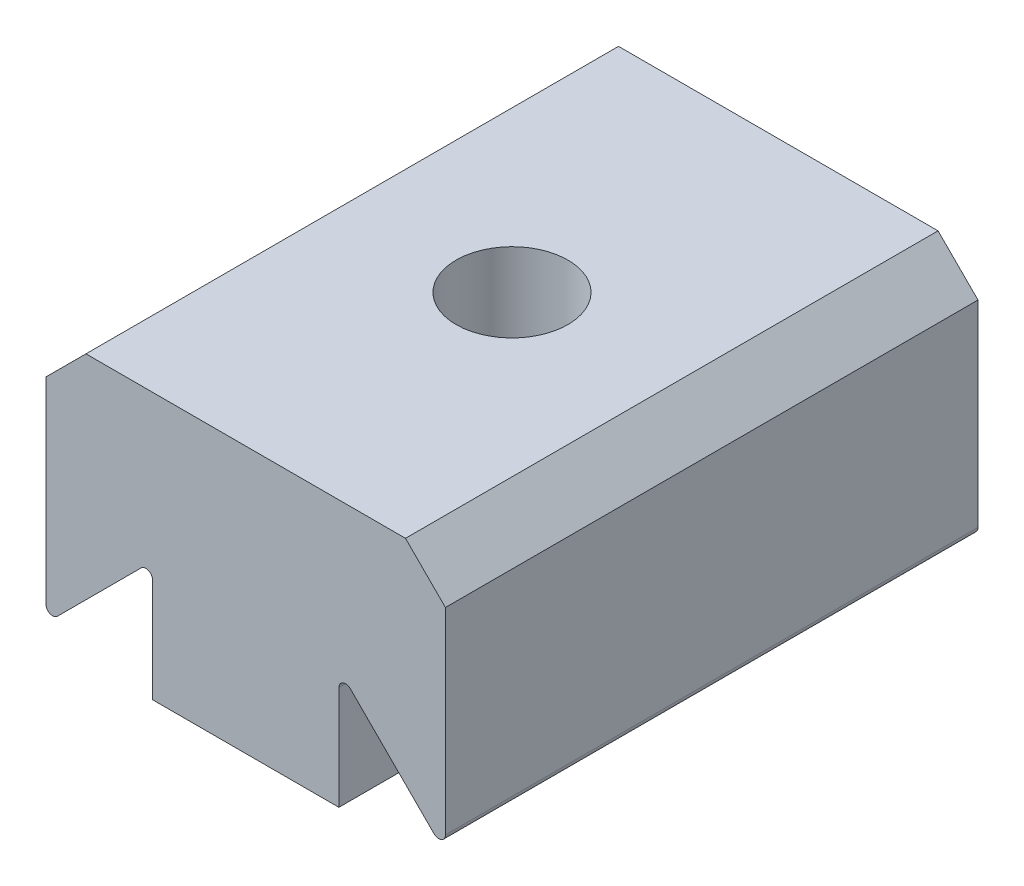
ISO-10303-21;
HEADER;
FILE_DESCRIPTION(('STEP AP214'),'2;1');
FILE_NAME('part.step','',(''),(''),'','','');
FILE_SCHEMA(('AUTOMOTIVE_DESIGN { 1 0 10303 214 1 1 1 1 }'));
ENDSEC;
DATA;
#1=APPLICATION_CONTEXT('core data for automotive mechanical design processes');
#2=APPLICATION_PROTOCOL_DEFINITION('international standard','automotive_design',2000,#1);
#3=PRODUCT_CONTEXT('',#1,'mechanical');
#4=PRODUCT('Part','Part','',(#3));
#5=PRODUCT_RELATED_PRODUCT_CATEGORY('part','',(#4));
#6=PRODUCT_DEFINITION_FORMATION('','',#4);
#7=PRODUCT_DEFINITION_CONTEXT('part definition',#1,'design');
#8=PRODUCT_DEFINITION('design','',#6,#7);
#9=PRODUCT_DEFINITION_SHAPE('','',#8);
#10=(LENGTH_UNIT() NAMED_UNIT(*) SI_UNIT(.MILLI.,.METRE.));
#11=(NAMED_UNIT(*) PLANE_ANGLE_UNIT() SI_UNIT($,.RADIAN.));
#12=(NAMED_UNIT(*) SI_UNIT($,.STERADIAN.) SOLID_ANGLE_UNIT());
#13=UNCERTAINTY_MEASURE_WITH_UNIT(LENGTH_MEASURE(1.E-05),#10,'distance_accuracy_value','');
#14=(GEOMETRIC_REPRESENTATION_CONTEXT(3) GLOBAL_UNCERTAINTY_ASSIGNED_CONTEXT((#13)) GLOBAL_UNIT_ASSIGNED_CONTEXT((#10,
#11,#12)) REPRESENTATION_CONTEXT('',''));
#15=CARTESIAN_POINT('',(0.,0.,0.));
#16=DIRECTION('',(0.,0.,1.));
#17=DIRECTION('',(1.,0.,0.));
#18=AXIS2_PLACEMENT_3D('',#15,#16,#17);
#19=CARTESIAN_POINT('',(-11.,16.5,10.));
#20=DIRECTION('',(0.,1.,0.));
#21=DIRECTION('',(0.,0.,1.));
#22=AXIS2_PLACEMENT_3D('',#19,#20,#21);
#23=PLANE('',#22);
#24=CARTESIAN_POINT('',(-3.5,16.5,0.));
#25=DIRECTION('',(0.,1.,0.));
#26=DIRECTION('',(0.,0.,1.));
#27=AXIS2_PLACEMENT_3D('',#24,#25,#26);
#28=CIRCLE('',#27,2.1);
#29=CARTESIAN_POINT('',(-3.5,16.5,2.09999999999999));
#30=VERTEX_POINT('',#29);
#31=EDGE_CURVE('E307',#30,#30,#28,.T.);
#32=ORIENTED_EDGE('',*,*,#31,.T.);
#33=EDGE_LOOP('',(#32));
#34=FACE_BOUND('',#33,.T.);
#35=DIRECTION('',(0.,0.,1.));
#36=VECTOR('',#35,1.);
#37=CARTESIAN_POINT('',(-7.00000000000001,16.5,10.));
#38=LINE('',#37,#36);
#39=CARTESIAN_POINT('',(-7.00000000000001,16.5,-10.));
#40=VERTEX_POINT('',#39);
#41=CARTESIAN_POINT('',(-7.00000000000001,16.5,10.));
#42=VERTEX_POINT('',#41);
#43=EDGE_CURVE('E171',#40,#42,#38,.T.);
#44=ORIENTED_EDGE('',*,*,#43,.F.);
#45=DIRECTION('',(1.,0.,0.));
#46=VECTOR('',#45,1.);
#47=CARTESIAN_POINT('',(-11.,16.5,-10.));
#48=LINE('',#47,#46);
#49=CARTESIAN_POINT('',(0.,16.5,-10.));
#50=VERTEX_POINT('',#49);
#51=EDGE_CURVE('E219',#40,#50,#48,.T.);
#52=ORIENTED_EDGE('',*,*,#51,.T.);
#53=DIRECTION('',(0.,0.,1.));
#54=VECTOR('',#53,1.);
#55=CARTESIAN_POINT('',(0.,16.5,10.));
#56=LINE('',#55,#54);
#57=CARTESIAN_POINT('',(0.,16.5,10.));
#58=VERTEX_POINT('',#57);
#59=EDGE_CURVE('E204',#50,#58,#56,.T.);
#60=ORIENTED_EDGE('',*,*,#59,.T.);
#61=DIRECTION('',(1.,0.,0.));
#62=VECTOR('',#61,1.);
#63=CARTESIAN_POINT('',(-11.,16.5,10.));
#64=LINE('',#63,#62);
#65=EDGE_CURVE('E227',#42,#58,#64,.T.);
#66=ORIENTED_EDGE('',*,*,#65,.F.);
#67=EDGE_LOOP('',(#44,#52,#60,#66));
#68=FACE_BOUND('',#67,.T.);
#69=ADVANCED_FACE('F28',(#34,#68),#23,.F.);
#70=CARTESIAN_POINT('',(4.,16.5,10.));
#71=DIRECTION('',(0.,0.,1.));
#72=DIRECTION('',(1.,0.,0.));
#73=AXIS2_PLACEMENT_3D('',#70,#71,#72);
#74=PLANE('',#73);
#75=DIRECTION('',(0.,1.,0.));
#76=VECTOR('',#75,1.);
#77=CARTESIAN_POINT('',(4.,26.5,10.));
#78=LINE('',#77,#76);
#79=CARTESIAN_POINT('',(4.,17.6035533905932,10.));
#80=VERTEX_POINT('',#79);
#81=CARTESIAN_POINT('',(4.,25.,10.));
#82=VERTEX_POINT('',#81);
#83=EDGE_CURVE('E221',#80,#82,#78,.T.);
#84=ORIENTED_EDGE('',*,*,#83,.T.);
#85=DIRECTION('',(0.707106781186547,-0.707106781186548,0.));
#86=VECTOR('',#85,1.);
#87=CARTESIAN_POINT('',(8.25000000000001,20.75,10.));
#88=LINE('',#87,#86);
#89=CARTESIAN_POINT('',(2.5,26.5,10.));
#90=VERTEX_POINT('',#89);
#91=EDGE_CURVE('E36',#82,#90,#88,.F.);
#92=ORIENTED_EDGE('',*,*,#91,.T.);
#93=DIRECTION('',(-1.,0.,0.));
#94=VECTOR('',#93,1.);
#95=CARTESIAN_POINT('',(-11.,26.5,9.99999999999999));
#96=LINE('',#95,#94);
#97=CARTESIAN_POINT('',(-9.50000000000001,26.5,9.99999999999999));
#98=VERTEX_POINT('',#97);
#99=EDGE_CURVE('E223',#90,#98,#96,.T.);
#100=ORIENTED_EDGE('',*,*,#99,.T.);
#101=DIRECTION('',(0.70710678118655,0.707106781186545,0.));
#102=VECTOR('',#101,1.);
#103=CARTESIAN_POINT('',(-7.74999999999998,28.25,9.99999999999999));
#104=LINE('',#103,#102);
#105=CARTESIAN_POINT('',(-11.,25.,9.99999999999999));
#106=VERTEX_POINT('',#105);
#107=EDGE_CURVE('E43',#98,#106,#104,.F.);
#108=ORIENTED_EDGE('',*,*,#107,.T.);
#109=DIRECTION('',(0.,-1.,0.));
#110=VECTOR('',#109,1.);
#111=CARTESIAN_POINT('',(-11.,26.5,9.99999999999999));
#112=LINE('',#111,#110);
#113=CARTESIAN_POINT('',(-11.,17.6035533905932,10.));
#114=VERTEX_POINT('',#113);
#115=EDGE_CURVE('E225',#106,#114,#112,.T.);
#116=ORIENTED_EDGE('',*,*,#115,.T.);
#117=CARTESIAN_POINT('',(-10.75,17.6035533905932,10.));
#118=DIRECTION('',(0.,0.,1.));
#119=DIRECTION('',(1.,0.,0.));
#120=AXIS2_PLACEMENT_3D('',#117,#118,#119);
#121=CIRCLE('',#120,0.250000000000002);
#122=CARTESIAN_POINT('',(-10.5732233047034,17.4267766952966,10.));
#123=VERTEX_POINT('',#122);
#124=EDGE_CURVE('E156',#114,#123,#121,.T.);
#125=ORIENTED_EDGE('',*,*,#124,.T.);
#126=DIRECTION('',(0.707106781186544,0.707106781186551,0.));
#127=VECTOR('',#126,1.);
#128=CARTESIAN_POINT('',(-10.5732233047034,17.4267766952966,10.));
#129=LINE('',#128,#127);
#130=CARTESIAN_POINT('',(-7.42677669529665,20.5732233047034,10.));
#131=VERTEX_POINT('',#130);
#132=EDGE_CURVE('E136',#123,#131,#129,.T.);
#133=ORIENTED_EDGE('',*,*,#132,.T.);
#134=CARTESIAN_POINT('',(-7.25000000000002,20.3964466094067,10.));
#135=DIRECTION('',(0.,0.,-1.));
#136=DIRECTION('',(-1.,0.,0.));
#137=AXIS2_PLACEMENT_3D('',#134,#135,#136);
#138=CIRCLE('',#137,0.249999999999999);
#139=CARTESIAN_POINT('',(-7.00000000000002,20.3964466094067,10.));
#140=VERTEX_POINT('',#139);
#141=EDGE_CURVE('E147',#131,#140,#138,.T.);
#142=ORIENTED_EDGE('',*,*,#141,.T.);
#143=DIRECTION('',(0.,-1.,0.));
#144=VECTOR('',#143,1.);
#145=CARTESIAN_POINT('',(-7.00000000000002,20.3964466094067,10.));
#146=LINE('',#145,#144);
#147=EDGE_CURVE('E158',#140,#42,#146,.T.);
#148=ORIENTED_EDGE('',*,*,#147,.T.);
#149=ORIENTED_EDGE('',*,*,#65,.T.);
#150=DIRECTION('',(0.,-1.,0.));
#151=VECTOR('',#150,1.);
#152=CARTESIAN_POINT('',(0.,20.3964466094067,10.));
#153=LINE('',#152,#151);
#154=CARTESIAN_POINT('',(0.,20.3964466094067,10.));
#155=VERTEX_POINT('',#154);
#156=EDGE_CURVE('E180',#155,#58,#153,.T.);
#157=ORIENTED_EDGE('',*,*,#156,.F.);
#158=CARTESIAN_POINT('',(0.25,20.3964466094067,10.));
#159=DIRECTION('',(0.,0.,1.));
#160=DIRECTION('',(1.,0.,0.));
#161=AXIS2_PLACEMENT_3D('',#158,#159,#160);
#162=CIRCLE('',#161,0.249999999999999);
#163=CARTESIAN_POINT('',(0.426776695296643,20.5732233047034,10.));
#164=VERTEX_POINT('',#163);
#165=EDGE_CURVE('E177',#164,#155,#162,.T.);
#166=ORIENTED_EDGE('',*,*,#165,.F.);
#167=DIRECTION('',(-0.707106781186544,0.707106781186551,0.));
#168=VECTOR('',#167,1.);
#169=CARTESIAN_POINT('',(3.57322330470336,17.4267766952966,10.));
#170=LINE('',#169,#168);
#171=CARTESIAN_POINT('',(3.57322330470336,17.4267766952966,10.));
#172=VERTEX_POINT('',#171);
#173=EDGE_CURVE('E186',#172,#164,#170,.T.);
#174=ORIENTED_EDGE('',*,*,#173,.F.);
#175=CARTESIAN_POINT('',(3.75,17.6035533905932,10.));
#176=DIRECTION('',(0.,0.,-1.));
#177=DIRECTION('',(-1.,0.,0.));
#178=AXIS2_PLACEMENT_3D('',#175,#176,#177);
#179=CIRCLE('',#178,0.250000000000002);
#180=EDGE_CURVE('E183',#80,#172,#179,.T.);
#181=ORIENTED_EDGE('',*,*,#180,.F.);
#182=EDGE_LOOP('',(#84,#92,#100,#108,#116,#125,#133,#142,#148,#149,#157,#166,#174,#181));
#183=FACE_BOUND('',#182,.T.);
#184=ADVANCED_FACE('F154',(#183),#74,.T.);
#185=CARTESIAN_POINT('',(4.,16.5,-10.));
#186=DIRECTION('',(0.,0.,1.));
#187=DIRECTION('',(1.,0.,0.));
#188=AXIS2_PLACEMENT_3D('',#185,#186,#187);
#189=PLANE('',#188);
#190=DIRECTION('',(-1.,0.,0.));
#191=VECTOR('',#190,1.);
#192=CARTESIAN_POINT('',(-11.,26.5,-10.));
#193=LINE('',#192,#191);
#194=CARTESIAN_POINT('',(2.5,26.5,-10.));
#195=VERTEX_POINT('',#194);
#196=CARTESIAN_POINT('',(-9.50000000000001,26.5,-10.));
#197=VERTEX_POINT('',#196);
#198=EDGE_CURVE('E214',#195,#197,#193,.T.);
#199=ORIENTED_EDGE('',*,*,#198,.F.);
#200=DIRECTION('',(-0.707106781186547,0.707106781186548,0.));
#201=VECTOR('',#200,1.);
#202=CARTESIAN_POINT('',(2.5,26.5,-10.));
#203=LINE('',#202,#201);
#204=CARTESIAN_POINT('',(4.,25.,-10.));
#205=VERTEX_POINT('',#204);
#206=EDGE_CURVE('E236',#195,#205,#203,.F.);
#207=ORIENTED_EDGE('',*,*,#206,.T.);
#208=DIRECTION('',(0.,1.,0.));
#209=VECTOR('',#208,1.);
#210=CARTESIAN_POINT('',(4.,26.5,-10.));
#211=LINE('',#210,#209);
#212=CARTESIAN_POINT('',(4.,17.6035533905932,-10.));
#213=VERTEX_POINT('',#212);
#214=EDGE_CURVE('E212',#213,#205,#211,.T.);
#215=ORIENTED_EDGE('',*,*,#214,.F.);
#216=CARTESIAN_POINT('',(3.75,17.6035533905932,-10.));
#217=DIRECTION('',(0.,0.,-1.));
#218=DIRECTION('',(-1.,0.,0.));
#219=AXIS2_PLACEMENT_3D('',#216,#217,#218);
#220=CIRCLE('',#219,0.250000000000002);
#221=CARTESIAN_POINT('',(3.57322330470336,17.4267766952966,-10.));
#222=VERTEX_POINT('',#221);
#223=EDGE_CURVE('E195',#213,#222,#220,.T.);
#224=ORIENTED_EDGE('',*,*,#223,.T.);
#225=DIRECTION('',(-0.707106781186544,0.707106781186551,0.));
#226=VECTOR('',#225,1.);
#227=CARTESIAN_POINT('',(3.57322330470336,17.4267766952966,-10.));
#228=LINE('',#227,#226);
#229=CARTESIAN_POINT('',(0.426776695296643,20.5732233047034,-10.));
#230=VERTEX_POINT('',#229);
#231=EDGE_CURVE('E198',#222,#230,#228,.T.);
#232=ORIENTED_EDGE('',*,*,#231,.T.);
#233=CARTESIAN_POINT('',(0.25,20.3964466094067,-10.));
#234=DIRECTION('',(0.,0.,1.));
#235=DIRECTION('',(1.,0.,0.));
#236=AXIS2_PLACEMENT_3D('',#233,#234,#235);
#237=CIRCLE('',#236,0.249999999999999);
#238=CARTESIAN_POINT('',(0.,20.3964466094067,-10.));
#239=VERTEX_POINT('',#238);
#240=EDGE_CURVE('E189',#230,#239,#237,.T.);
#241=ORIENTED_EDGE('',*,*,#240,.T.);
#242=DIRECTION('',(0.,-1.,0.));
#243=VECTOR('',#242,1.);
#244=CARTESIAN_POINT('',(0.,20.3964466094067,-10.));
#245=LINE('',#244,#243);
#246=EDGE_CURVE('E192',#239,#50,#245,.T.);
#247=ORIENTED_EDGE('',*,*,#246,.T.);
#248=ORIENTED_EDGE('',*,*,#51,.F.);
#249=DIRECTION('',(0.,-1.,0.));
#250=VECTOR('',#249,1.);
#251=CARTESIAN_POINT('',(-7.00000000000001,20.3964466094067,-10.));
#252=LINE('',#251,#250);
#253=CARTESIAN_POINT('',(-7.00000000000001,20.3964466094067,-10.));
#254=VERTEX_POINT('',#253);
#255=EDGE_CURVE('E143',#254,#40,#252,.T.);
#256=ORIENTED_EDGE('',*,*,#255,.F.);
#257=CARTESIAN_POINT('',(-7.25000000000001,20.3964466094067,-10.));
#258=DIRECTION('',(0.,0.,-1.));
#259=DIRECTION('',(-1.,0.,0.));
#260=AXIS2_PLACEMENT_3D('',#257,#258,#259);
#261=CIRCLE('',#260,0.249999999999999);
#262=CARTESIAN_POINT('',(-7.42677669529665,20.5732233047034,-10.));
#263=VERTEX_POINT('',#262);
#264=EDGE_CURVE('E163',#263,#254,#261,.T.);
#265=ORIENTED_EDGE('',*,*,#264,.F.);
#266=DIRECTION('',(0.707106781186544,0.707106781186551,0.));
#267=VECTOR('',#266,1.);
#268=CARTESIAN_POINT('',(-10.5732233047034,17.4267766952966,-10.));
#269=LINE('',#268,#267);
#270=CARTESIAN_POINT('',(-10.5732233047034,17.4267766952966,-10.));
#271=VERTEX_POINT('',#270);
#272=EDGE_CURVE('E139',#271,#263,#269,.T.);
#273=ORIENTED_EDGE('',*,*,#272,.F.);
#274=CARTESIAN_POINT('',(-10.75,17.6035533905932,-10.));
#275=DIRECTION('',(0.,0.,1.));
#276=DIRECTION('',(1.,0.,0.));
#277=AXIS2_PLACEMENT_3D('',#274,#275,#276);
#278=CIRCLE('',#277,0.250000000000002);
#279=CARTESIAN_POINT('',(-11.,17.6035533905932,-10.));
#280=VERTEX_POINT('',#279);
#281=EDGE_CURVE('E166',#280,#271,#278,.T.);
#282=ORIENTED_EDGE('',*,*,#281,.F.);
#283=DIRECTION('',(0.,-1.,0.));
#284=VECTOR('',#283,1.);
#285=CARTESIAN_POINT('',(-11.,26.5,-10.));
#286=LINE('',#285,#284);
#287=CARTESIAN_POINT('',(-11.,25.,-10.));
#288=VERTEX_POINT('',#287);
#289=EDGE_CURVE('E217',#288,#280,#286,.T.);
#290=ORIENTED_EDGE('',*,*,#289,.F.);
#291=DIRECTION('',(-0.70710678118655,-0.707106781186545,0.));
#292=VECTOR('',#291,1.);
#293=CARTESIAN_POINT('',(-11.,25.,-10.));
#294=LINE('',#293,#292);
#295=EDGE_CURVE('E234',#288,#197,#294,.F.);
#296=ORIENTED_EDGE('',*,*,#295,.T.);
#297=EDGE_LOOP('',(#199,#207,#215,#224,#232,#241,#247,#248,#256,#265,#273,#282,#290,#296));
#298=FACE_BOUND('',#297,.T.);
#299=ADVANCED_FACE('F251',(#298),#189,.F.);
#300=CARTESIAN_POINT('',(4.,26.5,10.));
#301=DIRECTION('',(-1.,0.,0.));
#302=DIRECTION('',(0.,0.,1.));
#303=AXIS2_PLACEMENT_3D('',#300,#301,#302);
#304=PLANE('',#303);
#305=ORIENTED_EDGE('',*,*,#214,.T.);
#306=DIRECTION('',(0.,0.,1.));
#307=VECTOR('',#306,1.);
#308=CARTESIAN_POINT('',(4.,25.,10.));
#309=LINE('',#308,#307);
#310=EDGE_CURVE('E51',#205,#82,#309,.T.);
#311=ORIENTED_EDGE('',*,*,#310,.T.);
#312=ORIENTED_EDGE('',*,*,#83,.F.);
#313=DIRECTION('',(0.,0.,1.));
#314=VECTOR('',#313,1.);
#315=CARTESIAN_POINT('',(4.,17.6035533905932,-10.));
#316=LINE('',#315,#314);
#317=EDGE_CURVE('E207',#213,#80,#316,.T.);
#318=ORIENTED_EDGE('',*,*,#317,.F.);
#319=EDGE_LOOP('',(#305,#311,#312,#318));
#320=FACE_BOUND('',#319,.T.);
#321=ADVANCED_FACE('F30',(#320),#304,.F.);
#322=CARTESIAN_POINT('',(-11.,26.5,9.99999999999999));
#323=DIRECTION('',(0.,-1.,0.));
#324=DIRECTION('',(0.,0.,-1.));
#325=AXIS2_PLACEMENT_3D('',#322,#323,#324);
#326=PLANE('',#325);
#327=CARTESIAN_POINT('',(-3.5,26.5,0.));
#328=DIRECTION('',(0.,1.,0.));
#329=DIRECTION('',(0.,0.,1.));
#330=AXIS2_PLACEMENT_3D('',#327,#328,#329);
#331=CIRCLE('',#330,2.09999999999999);
#332=CARTESIAN_POINT('',(-3.5,26.5,2.09999999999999));
#333=VERTEX_POINT('',#332);
#334=EDGE_CURVE('E152',#333,#333,#331,.T.);
#335=ORIENTED_EDGE('',*,*,#334,.F.);
#336=EDGE_LOOP('',(#335));
#337=FACE_BOUND('',#336,.T.);
#338=ORIENTED_EDGE('',*,*,#99,.F.);
#339=DIRECTION('',(0.,0.,-1.));
#340=VECTOR('',#339,1.);
#341=CARTESIAN_POINT('',(2.5,26.5,10.));
#342=LINE('',#341,#340);
#343=EDGE_CURVE('E231',#90,#195,#342,.T.);
#344=ORIENTED_EDGE('',*,*,#343,.T.);
#345=ORIENTED_EDGE('',*,*,#198,.T.);
#346=DIRECTION('',(0.,0.,1.));
#347=VECTOR('',#346,1.);
#348=CARTESIAN_POINT('',(-9.50000000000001,26.5,9.99999999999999));
#349=LINE('',#348,#347);
#350=EDGE_CURVE('E229',#197,#98,#349,.T.);
#351=ORIENTED_EDGE('',*,*,#350,.T.);
#352=EDGE_LOOP('',(#338,#344,#345,#351));
#353=FACE_BOUND('',#352,.T.);
#354=ADVANCED_FACE('F245',(#337,#353),#326,.F.);
#355=CARTESIAN_POINT('',(-11.,26.5,9.99999999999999));
#356=DIRECTION('',(1.,0.,0.));
#357=DIRECTION('',(0.,1.,0.));
#358=AXIS2_PLACEMENT_3D('',#355,#356,#357);
#359=PLANE('',#358);
#360=ORIENTED_EDGE('',*,*,#115,.F.);
#361=DIRECTION('',(0.,0.,-1.));
#362=VECTOR('',#361,1.);
#363=CARTESIAN_POINT('',(-11.,25.,9.99999999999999));
#364=LINE('',#363,#362);
#365=EDGE_CURVE('E11',#106,#288,#364,.T.);
#366=ORIENTED_EDGE('',*,*,#365,.T.);
#367=ORIENTED_EDGE('',*,*,#289,.T.);
#368=DIRECTION('',(0.,0.,1.));
#369=VECTOR('',#368,1.);
#370=CARTESIAN_POINT('',(-11.,17.6035533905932,-10.));
#371=LINE('',#370,#369);
#372=EDGE_CURVE('E172',#280,#114,#371,.T.);
#373=ORIENTED_EDGE('',*,*,#372,.T.);
#374=EDGE_LOOP('',(#360,#366,#367,#373));
#375=FACE_BOUND('',#374,.T.);
#376=ADVANCED_FACE('F296',(#375),#359,.F.);
#377=CARTESIAN_POINT('',(0.,20.3964466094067,-10.));
#378=DIRECTION('',(-1.,0.,0.));
#379=DIRECTION('',(0.,-1.,0.));
#380=AXIS2_PLACEMENT_3D('',#377,#378,#379);
#381=PLANE('',#380);
#382=ORIENTED_EDGE('',*,*,#246,.F.);
#383=DIRECTION('',(0.,0.,1.));
#384=VECTOR('',#383,1.);
#385=CARTESIAN_POINT('',(0.,20.3964466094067,-10.));
#386=LINE('',#385,#384);
#387=EDGE_CURVE('E201',#239,#155,#386,.T.);
#388=ORIENTED_EDGE('',*,*,#387,.T.);
#389=ORIENTED_EDGE('',*,*,#156,.T.);
#390=ORIENTED_EDGE('',*,*,#59,.F.);
#391=EDGE_LOOP('',(#382,#388,#389,#390));
#392=FACE_BOUND('',#391,.T.);
#393=ADVANCED_FACE('F268',(#392),#381,.F.);
#394=CARTESIAN_POINT('',(0.25,20.3964466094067,-10.));
#395=DIRECTION('',(0.,0.,1.));
#396=DIRECTION('',(1.,0.,0.));
#397=AXIS2_PLACEMENT_3D('',#394,#395,#396);
#398=CYLINDRICAL_SURFACE('',#397,0.249999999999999);
#399=ORIENTED_EDGE('',*,*,#165,.T.);
#400=ORIENTED_EDGE('',*,*,#387,.F.);
#401=ORIENTED_EDGE('',*,*,#240,.F.);
#402=DIRECTION('',(0.,0.,1.));
#403=VECTOR('',#402,1.);
#404=CARTESIAN_POINT('',(0.426776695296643,20.5732233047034,-10.));
#405=LINE('',#404,#403);
#406=EDGE_CURVE('E202',#230,#164,#405,.T.);
#407=ORIENTED_EDGE('',*,*,#406,.T.);
#408=EDGE_LOOP('',(#399,#400,#401,#407));
#409=FACE_BOUND('',#408,.T.);
#410=ADVANCED_FACE('F265',(#409),#398,.F.);
#411=CARTESIAN_POINT('',(3.57322330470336,17.4267766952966,-10.));
#412=DIRECTION('',(0.707106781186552,0.707106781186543,0.));
#413=DIRECTION('',(-0.707106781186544,0.707106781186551,0.));
#414=AXIS2_PLACEMENT_3D('',#411,#412,#413);
#415=PLANE('',#414);
#416=ORIENTED_EDGE('',*,*,#173,.T.);
#417=ORIENTED_EDGE('',*,*,#406,.F.);
#418=ORIENTED_EDGE('',*,*,#231,.F.);
#419=DIRECTION('',(0.,0.,1.));
#420=VECTOR('',#419,1.);
#421=CARTESIAN_POINT('',(3.57322330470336,17.4267766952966,-10.));
#422=LINE('',#421,#420);
#423=EDGE_CURVE('E205',#222,#172,#422,.T.);
#424=ORIENTED_EDGE('',*,*,#423,.T.);
#425=EDGE_LOOP('',(#416,#417,#418,#424));
#426=FACE_BOUND('',#425,.T.);
#427=ADVANCED_FACE('F259',(#426),#415,.F.);
#428=CARTESIAN_POINT('',(3.75,17.6035533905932,-10.));
#429=DIRECTION('',(0.,0.,1.));
#430=DIRECTION('',(1.,0.,0.));
#431=AXIS2_PLACEMENT_3D('',#428,#429,#430);
#432=CYLINDRICAL_SURFACE('',#431,0.250000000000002);
#433=ORIENTED_EDGE('',*,*,#180,.T.);
#434=ORIENTED_EDGE('',*,*,#423,.F.);
#435=ORIENTED_EDGE('',*,*,#223,.F.);
#436=ORIENTED_EDGE('',*,*,#317,.T.);
#437=EDGE_LOOP('',(#433,#434,#435,#436));
#438=FACE_BOUND('',#437,.T.);
#439=ADVANCED_FACE('F254',(#438),#432,.T.);
#440=CARTESIAN_POINT('',(-7.00000000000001,20.3964466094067,-10.));
#441=DIRECTION('',(-1.,0.,0.));
#442=DIRECTION('',(0.,-1.,0.));
#443=AXIS2_PLACEMENT_3D('',#440,#441,#442);
#444=PLANE('',#443);
#445=ORIENTED_EDGE('',*,*,#43,.T.);
#446=ORIENTED_EDGE('',*,*,#147,.F.);
#447=DIRECTION('',(0.,0.,1.));
#448=VECTOR('',#447,1.);
#449=CARTESIAN_POINT('',(-7.00000000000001,20.3964466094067,-10.));
#450=LINE('',#449,#448);
#451=EDGE_CURVE('E150',#254,#140,#450,.T.);
#452=ORIENTED_EDGE('',*,*,#451,.F.);
#453=ORIENTED_EDGE('',*,*,#255,.T.);
#454=EDGE_LOOP('',(#445,#446,#452,#453));
#455=FACE_BOUND('',#454,.T.);
#456=ADVANCED_FACE('F274',(#455),#444,.T.);
#457=CARTESIAN_POINT('',(-7.25000000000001,20.3964466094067,-10.));
#458=DIRECTION('',(0.,0.,1.));
#459=DIRECTION('',(1.,0.,0.));
#460=AXIS2_PLACEMENT_3D('',#457,#458,#459);
#461=CYLINDRICAL_SURFACE('',#460,0.249999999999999);
#462=ORIENTED_EDGE('',*,*,#141,.F.);
#463=DIRECTION('',(0.,0.,1.));
#464=VECTOR('',#463,1.);
#465=CARTESIAN_POINT('',(-7.42677669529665,20.5732233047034,-10.));
#466=LINE('',#465,#464);
#467=EDGE_CURVE('E132',#263,#131,#466,.T.);
#468=ORIENTED_EDGE('',*,*,#467,.F.);
#469=ORIENTED_EDGE('',*,*,#264,.T.);
#470=ORIENTED_EDGE('',*,*,#451,.T.);
#471=EDGE_LOOP('',(#462,#468,#469,#470));
#472=FACE_BOUND('',#471,.T.);
#473=ADVANCED_FACE('F148',(#472),#461,.F.);
#474=CARTESIAN_POINT('',(-10.75,17.6035533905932,-10.));
#475=DIRECTION('',(0.,0.,1.));
#476=DIRECTION('',(1.,0.,0.));
#477=AXIS2_PLACEMENT_3D('',#474,#475,#476);
#478=CYLINDRICAL_SURFACE('',#477,0.250000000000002);
#479=ORIENTED_EDGE('',*,*,#124,.F.);
#480=ORIENTED_EDGE('',*,*,#372,.F.);
#481=ORIENTED_EDGE('',*,*,#281,.T.);
#482=DIRECTION('',(0.,0.,1.));
#483=VECTOR('',#482,1.);
#484=CARTESIAN_POINT('',(-10.5732233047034,17.4267766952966,-10.));
#485=LINE('',#484,#483);
#486=EDGE_CURVE('E142',#271,#123,#485,.T.);
#487=ORIENTED_EDGE('',*,*,#486,.T.);
#488=EDGE_LOOP('',(#479,#480,#481,#487));
#489=FACE_BOUND('',#488,.T.);
#490=ADVANCED_FACE('F281',(#489),#478,.T.);
#491=CARTESIAN_POINT('',(-10.5732233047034,17.4267766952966,-10.));
#492=DIRECTION('',(0.707106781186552,-0.707106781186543,0.));
#493=DIRECTION('',(0.707106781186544,0.707106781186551,0.));
#494=AXIS2_PLACEMENT_3D('',#491,#492,#493);
#495=PLANE('',#494);
#496=ORIENTED_EDGE('',*,*,#132,.F.);
#497=ORIENTED_EDGE('',*,*,#486,.F.);
#498=ORIENTED_EDGE('',*,*,#272,.T.);
#499=ORIENTED_EDGE('',*,*,#467,.T.);
#500=EDGE_LOOP('',(#496,#497,#498,#499));
#501=FACE_BOUND('',#500,.T.);
#502=ADVANCED_FACE('F134',(#501),#495,.T.);
#503=CARTESIAN_POINT('',(2.5,26.5,10.));
#504=DIRECTION('',(-0.707106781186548,-0.707106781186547,0.));
#505=DIRECTION('',(0.707106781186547,-0.707106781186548,0.));
#506=AXIS2_PLACEMENT_3D('',#503,#504,#505);
#507=PLANE('',#506);
#508=ORIENTED_EDGE('',*,*,#91,.F.);
#509=ORIENTED_EDGE('',*,*,#310,.F.);
#510=ORIENTED_EDGE('',*,*,#206,.F.);
#511=ORIENTED_EDGE('',*,*,#343,.F.);
#512=EDGE_LOOP('',(#508,#509,#510,#511));
#513=FACE_BOUND('',#512,.T.);
#514=ADVANCED_FACE('F248',(#513),#507,.F.);
#515=CARTESIAN_POINT('',(-11.,25.,9.99999999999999));
#516=DIRECTION('',(0.707106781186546,-0.707106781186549,0.));
#517=DIRECTION('',(0.70710678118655,0.707106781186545,0.));
#518=AXIS2_PLACEMENT_3D('',#515,#516,#517);
#519=PLANE('',#518);
#520=ORIENTED_EDGE('',*,*,#107,.F.);
#521=ORIENTED_EDGE('',*,*,#350,.F.);
#522=ORIENTED_EDGE('',*,*,#295,.F.);
#523=ORIENTED_EDGE('',*,*,#365,.F.);
#524=EDGE_LOOP('',(#520,#521,#522,#523));
#525=FACE_BOUND('',#524,.T.);
#526=ADVANCED_FACE('F313',(#525),#519,.F.);
#527=CARTESIAN_POINT('',(-3.5,26.5,0.));
#528=DIRECTION('',(0.,1.,0.));
#529=DIRECTION('',(0.,0.,1.));
#530=AXIS2_PLACEMENT_3D('',#527,#528,#529);
#531=CYLINDRICAL_SURFACE('',#530,2.09999999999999);
#532=CARTESIAN_POINT('',(-3.5,16.5,2.09999999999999));
#533=CARTESIAN_POINT('',(-3.5,16.6041666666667,2.09999999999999));
#534=CARTESIAN_POINT('',(-3.5,16.7083333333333,2.09999999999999));
#535=CARTESIAN_POINT('',(-3.5,16.9166666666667,2.09999999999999));
#536=CARTESIAN_POINT('',(-3.5,17.0208333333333,2.09999999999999));
#537=CARTESIAN_POINT('',(-3.5,17.2291666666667,2.09999999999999));
#538=CARTESIAN_POINT('',(-3.5,17.3333333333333,2.09999999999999));
#539=CARTESIAN_POINT('',(-3.5,17.5416666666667,2.09999999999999));
#540=CARTESIAN_POINT('',(-3.5,17.6458333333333,2.09999999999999));
#541=CARTESIAN_POINT('',(-3.5,17.8541666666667,2.09999999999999));
#542=CARTESIAN_POINT('',(-3.5,17.9583333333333,2.09999999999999));
#543=CARTESIAN_POINT('',(-3.5,18.1666666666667,2.09999999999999));
#544=CARTESIAN_POINT('',(-3.5,18.2708333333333,2.09999999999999));
#545=CARTESIAN_POINT('',(-3.5,18.4791666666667,2.09999999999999));
#546=CARTESIAN_POINT('',(-3.5,18.5833333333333,2.09999999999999));
#547=CARTESIAN_POINT('',(-3.5,18.7916666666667,2.09999999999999));
#548=CARTESIAN_POINT('',(-3.5,18.8958333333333,2.09999999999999));
#549=CARTESIAN_POINT('',(-3.5,19.1041666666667,2.09999999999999));
#550=CARTESIAN_POINT('',(-3.5,19.2083333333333,2.09999999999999));
#551=CARTESIAN_POINT('',(-3.5,19.4166666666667,2.09999999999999));
#552=CARTESIAN_POINT('',(-3.5,19.5208333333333,2.09999999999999));
#553=CARTESIAN_POINT('',(-3.5,19.7291666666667,2.09999999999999));
#554=CARTESIAN_POINT('',(-3.5,19.8333333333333,2.09999999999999));
#555=CARTESIAN_POINT('',(-3.5,20.0416666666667,2.09999999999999));
#556=CARTESIAN_POINT('',(-3.5,20.1458333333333,2.09999999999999));
#557=CARTESIAN_POINT('',(-3.5,20.3541666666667,2.09999999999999));
#558=CARTESIAN_POINT('',(-3.5,20.4583333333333,2.09999999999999));
#559=CARTESIAN_POINT('',(-3.5,20.6666666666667,2.09999999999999));
#560=CARTESIAN_POINT('',(-3.5,20.7708333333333,2.09999999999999));
#561=CARTESIAN_POINT('',(-3.5,20.9791666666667,2.09999999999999));
#562=CARTESIAN_POINT('',(-3.5,21.0833333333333,2.09999999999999));
#563=CARTESIAN_POINT('',(-3.5,21.2916666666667,2.09999999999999));
#564=CARTESIAN_POINT('',(-3.5,21.3958333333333,2.09999999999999));
#565=CARTESIAN_POINT('',(-3.5,21.6041666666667,2.09999999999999));
#566=CARTESIAN_POINT('',(-3.5,21.7083333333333,2.09999999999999));
#567=CARTESIAN_POINT('',(-3.5,21.9166666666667,2.09999999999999));
#568=CARTESIAN_POINT('',(-3.5,22.0208333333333,2.09999999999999));
#569=CARTESIAN_POINT('',(-3.5,22.2291666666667,2.09999999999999));
#570=CARTESIAN_POINT('',(-3.5,22.3333333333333,2.09999999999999));
#571=CARTESIAN_POINT('',(-3.5,22.5416666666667,2.09999999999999));
#572=CARTESIAN_POINT('',(-3.5,22.6458333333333,2.09999999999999));
#573=CARTESIAN_POINT('',(-3.5,22.8541666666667,2.09999999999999));
#574=CARTESIAN_POINT('',(-3.5,22.9583333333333,2.09999999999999));
#575=CARTESIAN_POINT('',(-3.5,23.1666666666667,2.09999999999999));
#576=CARTESIAN_POINT('',(-3.5,23.2708333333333,2.09999999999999));
#577=CARTESIAN_POINT('',(-3.5,23.4791666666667,2.09999999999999));
#578=CARTESIAN_POINT('',(-3.5,23.5833333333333,2.09999999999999));
#579=CARTESIAN_POINT('',(-3.5,23.7916666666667,2.09999999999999));
#580=CARTESIAN_POINT('',(-3.5,23.8958333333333,2.09999999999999));
#581=CARTESIAN_POINT('',(-3.5,24.1041666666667,2.09999999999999));
#582=CARTESIAN_POINT('',(-3.5,24.2083333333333,2.09999999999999));
#583=CARTESIAN_POINT('',(-3.5,24.4166666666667,2.09999999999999));
#584=CARTESIAN_POINT('',(-3.5,24.5208333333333,2.09999999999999));
#585=CARTESIAN_POINT('',(-3.5,24.7291666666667,2.09999999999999));
#586=CARTESIAN_POINT('',(-3.5,24.8333333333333,2.09999999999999));
#587=CARTESIAN_POINT('',(-3.5,25.0416666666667,2.09999999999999));
#588=CARTESIAN_POINT('',(-3.5,25.1458333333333,2.09999999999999));
#589=CARTESIAN_POINT('',(-3.5,25.3541666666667,2.09999999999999));
#590=CARTESIAN_POINT('',(-3.5,25.4583333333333,2.09999999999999));
#591=CARTESIAN_POINT('',(-3.5,25.6666666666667,2.09999999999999));
#592=CARTESIAN_POINT('',(-3.5,25.7708333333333,2.09999999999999));
#593=CARTESIAN_POINT('',(-3.5,25.9791666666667,2.09999999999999));
#594=CARTESIAN_POINT('',(-3.5,26.0833333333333,2.09999999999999));
#595=CARTESIAN_POINT('',(-3.5,26.2916666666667,2.09999999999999));
#596=CARTESIAN_POINT('',(-3.5,26.3958333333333,2.09999999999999));
#597=CARTESIAN_POINT('',(-3.5,26.5,2.09999999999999));
#598=B_SPLINE_CURVE_WITH_KNOTS('',3,(#532,#533,#534,#535,#536,#537,#538,#539,#540,#541,#542,
#543,#544,#545,#546,#547,#548,#549,#550,#551,#552,#553,#554,#555,#556,#557,#558,#559,#560,#561,
#562,#563,#564,#565,#566,#567,#568,#569,#570,#571,#572,#573,#574,#575,#576,#577,#578,#579,#580,
#581,#582,#583,#584,#585,#586,#587,#588,#589,#590,#591,#592,#593,#594,#595,#596,#597),
.UNSPECIFIED.,.F.,.F.,(4,2,2,2,2,2,2,2,2,2,2,2,2,2,2,2,2,2,2,2,2,2,2,2,2,2,2,2,2,2,2,2,4),(0.,
0.3125,0.625000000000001,0.937500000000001,1.25,1.5625,1.875,2.1875,2.5,2.8125,3.125,3.4375,
3.75,4.0625,4.375,4.6875,5.,5.3125,5.625,5.9375,6.25,6.5625,6.875,7.1875,7.5,7.8125,8.125,
8.4375,8.75,9.0625,9.375,9.6875,9.99999999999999),.UNSPECIFIED.);
#599=EDGE_CURVE('BSEAM311',#30,#333,#598,.T.);
#600=ORIENTED_EDGE('',*,*,#31,.F.);
#601=ORIENTED_EDGE('',*,*,#334,.T.);
#602=ORIENTED_EDGE('',*,*,#599,.T.);
#603=ORIENTED_EDGE('',*,*,#599,.F.);
#604=EDGE_LOOP('',(#600,#602,#601,#603));
#605=FACE_BOUND('',#604,.T.);
#606=ADVANCED_FACE('F311',(#605),#531,.F.);
#607=CLOSED_SHELL('',(#69,#184,#299,#321,#354,#376,#393,#410,#427,#439,#456,#473,#490,#502,#514,
#526,#606));
#608=MANIFOLD_SOLID_BREP('B2',#607);
#609=ADVANCED_BREP_SHAPE_REPRESENTATION('',(#18,#608),#14);
#610=SHAPE_DEFINITION_REPRESENTATION(#9,#609);
ENDSEC;
END-ISO-10303-21;
